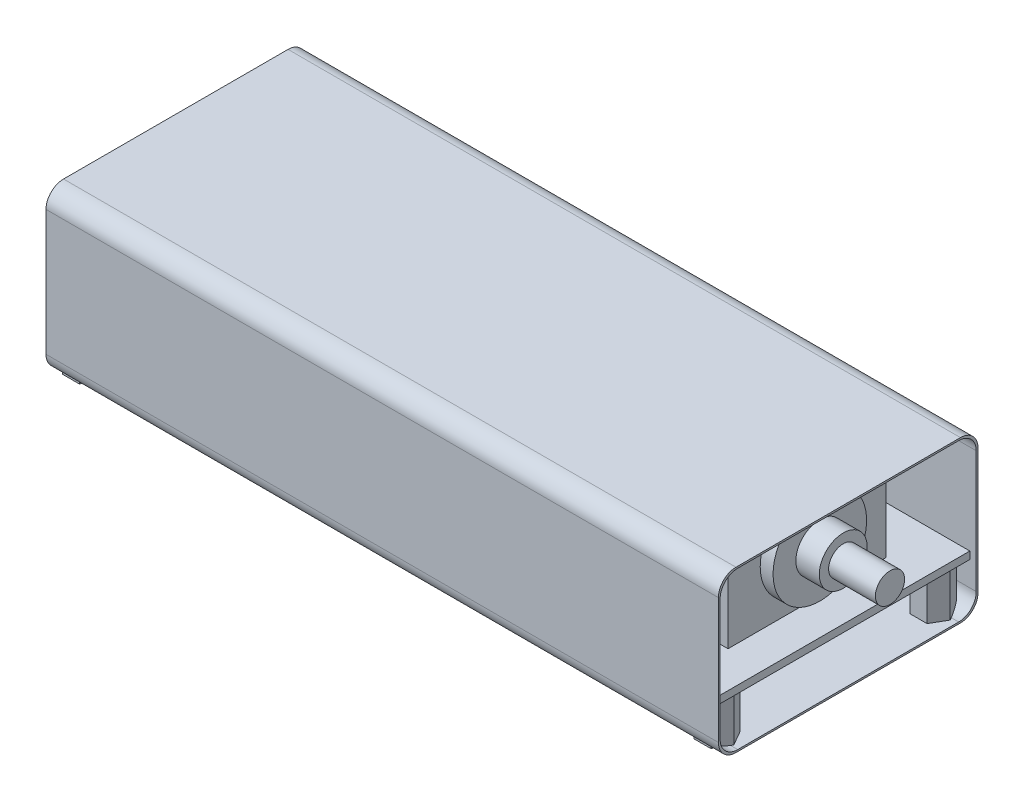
from build123d import *

# Parameters (mm, degrees)
SKETCH1_W            = 145.034
SKETCH1_H            = 54.991
BASE_EXTRUDE_DEPTH   = 1.6002
SKETCH2_W            = 87.884
SKETCH2_H            = 54.991
BOSS_EXTRUDE1_DEPTH  = 12.7
CONN_COMM_DEPTH      = 2.54
CONN_COMM_DEPTH_BACK = 6.35
SKETCH16_W           = 20.32
SKETCH16_H           = 9.144
SKETCH17_W           = 5.08
SKETCH17_H           = 10.16
CONN_PINS_DEPTH      = 16.51
SKETCH17_W_2         = 7.62
SKETCH17_H_2         = 2.54
CONN_PINS_2_DEPTH    = 16.51
SKETCH14_W           = 20.052826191
SKETCH14_H           = 12.7
COILS_DEPTH          = 9.525
SKETCH3_W            = 12.446
SKETCH3_H            = 34.29
BOSS_EXTRUDE2_DEPTH  = 22.606
SKETCH6_R            = 1.27
HEXSTNDOFF_DEPTH     = 9.525
SHIELD_DEPTH         = 146.05
CUT_EXTRUDE1_START   = -6.35
SKETCH18_R           = 1.27
CUT_EXTRUDE1_DEPTH   = 6.35


with BuildPart() as part:
    # Sketch1 → Base-Extrude (new body)
    with BuildSketch(Plane(origin=(0, 0, 0), x_dir=(1, 0, 0), z_dir=(0, 1, 0))):
        with Locations((72.517, 27.4955)):
            Rectangle(SKETCH1_W, SKETCH1_H)
    extrude(amount=BASE_EXTRUDE_DEPTH)

    # Sketch2 → Boss-Extrude1 (add)
    with BuildSketch(Plane(origin=(0, 1.6002, 0), x_dir=(-1, 0, 0), z_dir=(0, 1, 0))):
        with Locations((-43.942, -27.4955)):
            Rectangle(SKETCH2_W, SKETCH2_H)
    extrude(amount=BOSS_EXTRUDE1_DEPTH)

    # Sketch16 → Conn Comm (add, two sides: drawn at the far end of the back side and taken through both)
    with BuildSketch(Plane.ZY.offset(-CONN_COMM_DEPTH_BACK)):
        with Locations((-27.4955, 13.462)):
            Rectangle(SKETCH16_W, SKETCH16_H)
    extrude(amount=CONN_COMM_DEPTH + CONN_COMM_DEPTH_BACK)

    # Sketch14 → Coils (add)
    with BuildSketch(Plane.XZ):
        with Locations((67.762988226, -14.403423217)):
            Rectangle(SKETCH14_W, SKETCH14_H)
        with Locations((67.762988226, -38.458362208)):
            Rectangle(SKETCH14_W, SKETCH14_H)
    extrude(amount=COILS_DEPTH)

    # Sketch3 → Boss-Extrude2 (add)
    with BuildSketch(Plane(origin=(0, 1.6002, 0), x_dir=(-1, 0, 0), z_dir=(0, 1, 0))):
        with Locations((-130.937, -27.4955)):
            Rectangle(SKETCH3_W, SKETCH3_H)
    extrude(amount=BOSS_EXTRUDE2_DEPTH)

    # Sketch4 → Boss-Revolve1 (revolve)
    with BuildSketch(Plane(origin=(0, 13.5382, 0), x_dir=(-1, 0, 0), z_dir=(0, 1, 0)), mode=Mode.PRIVATE) as boss_revolve1_sk:
        Polygon((-155.194, -27.4955), (-155.194, -30.6705), (-145.034, -30.6705), (-145.034, -32.7025), (-139.954, -32.7025), (-139.954, -37.6555), (-137.16, -37.6555), (-137.16, -27.4955), align=None)
    revolve(boss_revolve1_sk.sketch.rotate(Axis((137.16, 13.5382, -27.4955), (1, 0, 0)), 180), axis=Axis((137.16, 13.5382, -27.4955), (1, 0, 0)))

    # Sketch5 → Boss-Revolve2 (revolve)
    with BuildSketch(Plane(origin=(0, 13.5382, 0), x_dir=(-1, 0, 0), z_dir=(0, 1, 0))):
        Polygon((-124.714, -27.4955), (-124.714, -36.3855), (-122.936, -36.3855), (-122.936, -38.6715), (-105.918, -38.6715), (-105.918, -31.9405), (-96.393, -31.9405), (-96.393, -27.4955), align=None)
    revolve(axis=Axis((124.714, 13.5382, -27.4955), (-1, 0, 0)))

    # Sketch6 → HexStndOff (add)
    # profile 1 of 4: a face of its own
    with BuildSketch(Plane.XZ):
        Polygon((139.263912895, -7.1755), (142.930087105, -7.1755), (144.763174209, -4.0005), (142.930087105, -0.8255), (139.263912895, -0.8255), (137.430825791, -4.0005), align=None)
        with Locations(Location((141.097, -4.0005, 0), (0, 0, 90))):
            Circle(SKETCH6_R, mode=Mode.SUBTRACT)
    # profile 2 of 4: a face of its own
    with BuildSketch(Plane.XZ):
        Polygon((137.430825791, -50.9905), (139.263912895, -54.1655), (142.930087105, -54.1655), (144.763174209, -50.9905), (142.930087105, -47.8155), (139.263912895, -47.8155), align=None)
        with Locations(Location((141.097, -50.9905, 0), (0, 0, 90))):
            Circle(SKETCH6_R, mode=Mode.SUBTRACT)
    # profile 3 of 4: a face of its own
    with BuildSketch(Plane.XZ):
        Polygon((2.103912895, -7.1755), (5.770087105, -7.1755), (7.603174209, -4.0005), (5.770087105, -0.8255), (2.103912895, -0.8255), (0.270825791, -4.0005), align=None)
        with Locations(Location((3.937, -4.0005, 0), (0, 0, 90))):
            Circle(SKETCH6_R, mode=Mode.SUBTRACT)
    # profile 4 of 4: a face of its own
    with BuildSketch(Plane.XZ):
        Polygon((0.270825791, -50.9905), (2.103912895, -54.1655), (5.770087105, -54.1655), (7.603174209, -50.9905), (5.770087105, -47.8155), (2.103912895, -47.8155), align=None)
        with Locations(Location((3.937, -50.9905, 0), (0, 0, 90))):
            Circle(SKETCH6_R, mode=Mode.SUBTRACT)
    extrude(amount=HEXSTNDOFF_DEPTH)



with BuildPart() as body_2:
    # Sketch17 → Conn Pins (new body)
    with BuildSketch(Plane(origin=(0, 1.6002, 0), x_dir=(-1, 0, 0), z_dir=(0, 1, 0))):
        with Locations((-5.08, -47.371)):
            Rectangle(SKETCH17_W, SKETCH17_H)
    extrude(amount=CONN_PINS_DEPTH)


with BuildPart() as body_3:
    # Sketch17 → Conn Pins 2 (new body)
    with BuildSketch(Plane(origin=(0, 1.6002, 0), x_dir=(-1, 0, 0), z_dir=(0, 1, 0))):
        with Locations((-36.83, -6.35)):
            Rectangle(SKETCH17_W_2, SKETCH17_H_2)
    extrude(amount=CONN_PINS_2_DEPTH)


with BuildPart() as part_1:
    add(part.part)

    add(body_3.part)  # Shield merges body 3

    add(body_2.part)  # Shield merges body 2
    # Sketch7 → Shield (add)
    with BuildSketch(Plane(origin=(0, 0, 0), x_dir=(0, 0, -1), z_dir=(1, 0, 0))):
        with BuildLine():
            Line((3.175, 24.9682), (51.943, 24.9682))
            ThreePointArc((51.943, 24.9682), (54.637076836, 23.852276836), (55.753, 21.1582))
            Line((55.753, 21.1582), (55.753, -6.096))
            ThreePointArc((55.753, -6.096), (54.637076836, -8.790076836), (51.943, -9.906))
            Line((51.943, -9.906), (3.175, -9.906))
            ThreePointArc((3.175, -9.906), (0.480923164, -8.790076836), (-0.635, -6.096))
            Line((-0.635, -6.096), (-0.635, 21.1582))
            ThreePointArc((-0.635, 21.1582), (0.480923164, 23.852276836), (3.175, 24.9682))
        make_face()
        with BuildLine():
            Line((3.556, 24.5872), (51.562, 24.5872))
            ThreePointArc((51.562, 24.5872), (54.256076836, 23.471276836), (55.372, 20.7772))
            Line((55.372, 20.7772), (55.372, -5.715))
            ThreePointArc((55.372, -5.715), (54.256076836, -8.409076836), (51.562, -9.525))
            Line((51.562, -9.525), (3.556, -9.525))
            ThreePointArc((3.556, -9.525), (0.861923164, -8.409076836), (-0.254, -5.715))
            Line((-0.254, -5.715), (-0.254, 20.7772))
            ThreePointArc((-0.254, 20.7772), (0.861923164, 23.471276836), (3.556, 24.5872))
        make_face(mode=Mode.SUBTRACT)
    extrude(amount=SHIELD_DEPTH)

    # Sketch18 → Cut-Extrude1 (cut)
    with BuildSketch(Plane.XZ.offset(9.906).offset(CUT_EXTRUDE1_START)):
        with Locations(Location((3.937, -50.9905, 0), (0, 0, 311.409622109))):
            Circle(SKETCH18_R)
        with Locations(Location((141.097, -50.9905, 0), (0, 0, 228.590377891))):
            Circle(SKETCH18_R)
        with Locations(Location((141.097, -4.0005, 0), (0, 0, 40.541601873))):
            Circle(SKETCH18_R)
        with Locations(Location((3.937, -4.0005, 0), (0, 0, 40.541601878))):
            Circle(SKETCH18_R)
    extrude(amount=CUT_EXTRUDE1_DEPTH, mode=Mode.SUBTRACT)


solid = part_1.part
